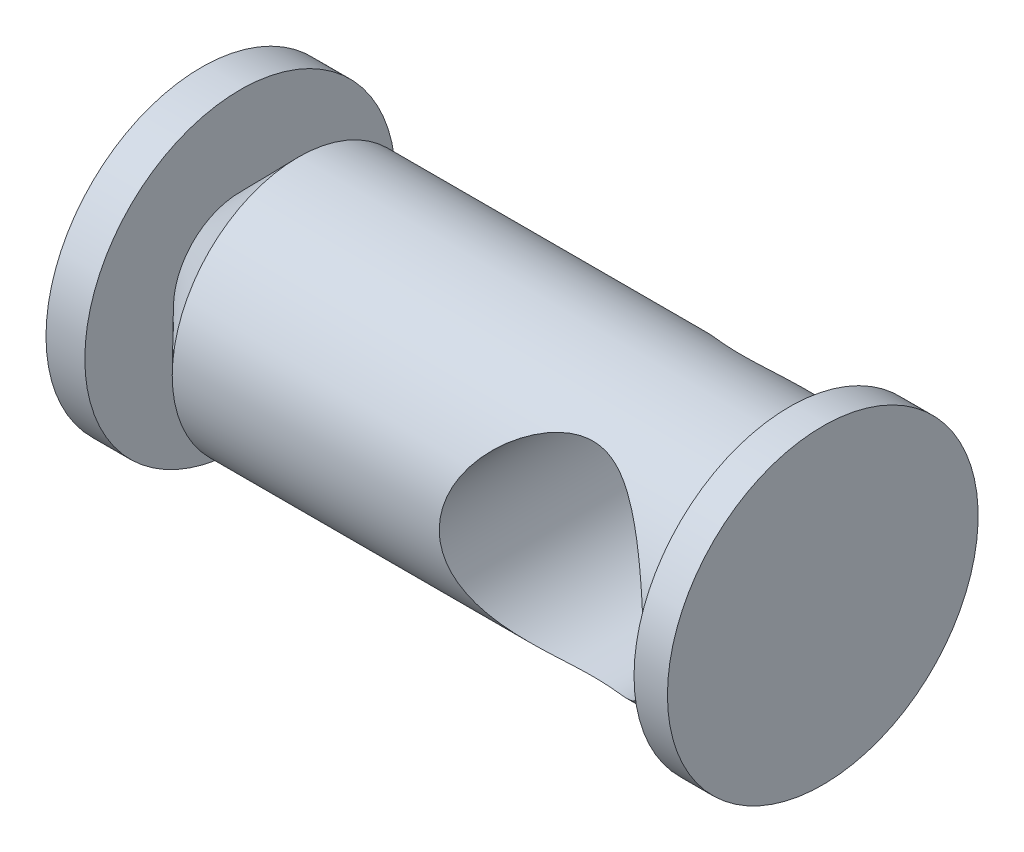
ISO-10303-21;
HEADER;
FILE_DESCRIPTION(('STEP AP214'),'2;1');
FILE_NAME('part.step','',(''),(''),'','','');
FILE_SCHEMA(('AUTOMOTIVE_DESIGN { 1 0 10303 214 1 1 1 1 }'));
ENDSEC;
DATA;
#1=APPLICATION_CONTEXT('core data for automotive mechanical design processes');
#2=APPLICATION_PROTOCOL_DEFINITION('international standard','automotive_design',2000,#1);
#3=PRODUCT_CONTEXT('',#1,'mechanical');
#4=PRODUCT('Part','Part','',(#3));
#5=PRODUCT_RELATED_PRODUCT_CATEGORY('part','',(#4));
#6=PRODUCT_DEFINITION_FORMATION('','',#4);
#7=PRODUCT_DEFINITION_CONTEXT('part definition',#1,'design');
#8=PRODUCT_DEFINITION('design','',#6,#7);
#9=PRODUCT_DEFINITION_SHAPE('','',#8);
#10=(LENGTH_UNIT() NAMED_UNIT(*) SI_UNIT(.MILLI.,.METRE.));
#11=(NAMED_UNIT(*) PLANE_ANGLE_UNIT() SI_UNIT($,.RADIAN.));
#12=(NAMED_UNIT(*) SI_UNIT($,.STERADIAN.) SOLID_ANGLE_UNIT());
#13=UNCERTAINTY_MEASURE_WITH_UNIT(LENGTH_MEASURE(1.E-05),#10,'distance_accuracy_value','');
#14=(GEOMETRIC_REPRESENTATION_CONTEXT(3) GLOBAL_UNCERTAINTY_ASSIGNED_CONTEXT((#13)) GLOBAL_UNIT_ASSIGNED_CONTEXT((#10,
#11,#12)) REPRESENTATION_CONTEXT('',''));
#15=CARTESIAN_POINT('',(0.,0.,0.));
#16=DIRECTION('',(0.,0.,1.));
#17=DIRECTION('',(1.,0.,0.));
#18=AXIS2_PLACEMENT_3D('',#15,#16,#17);
#19=CARTESIAN_POINT('',(-60.,8.,0.));
#20=DIRECTION('',(1.,0.,0.));
#21=DIRECTION('',(0.,0.,-1.));
#22=AXIS2_PLACEMENT_3D('',#19,#20,#21);
#23=PLANE('',#22);
#24=CARTESIAN_POINT('',(-60.,0.,0.));
#25=DIRECTION('',(-1.,0.,0.));
#26=DIRECTION('',(0.,0.,1.));
#27=AXIS2_PLACEMENT_3D('',#24,#25,#26);
#28=CIRCLE('',#27,3.);
#29=CARTESIAN_POINT('',(-60.,0.,3.));
#30=VERTEX_POINT('',#29);
#31=EDGE_CURVE('E104',#30,#30,#28,.T.);
#32=ORIENTED_EDGE('',*,*,#31,.F.);
#33=EDGE_LOOP('',(#32));
#34=FACE_BOUND('',#33,.T.);
#35=CARTESIAN_POINT('',(-60.,0.,0.));
#36=DIRECTION('',(-1.,0.,0.));
#37=DIRECTION('',(0.,0.,1.));
#38=AXIS2_PLACEMENT_3D('',#35,#36,#37);
#39=CIRCLE('',#38,8.);
#40=CARTESIAN_POINT('',(-60.,0.,8.));
#41=VERTEX_POINT('',#40);
#42=EDGE_CURVE('E142',#41,#41,#39,.T.);
#43=ORIENTED_EDGE('',*,*,#42,.T.);
#44=EDGE_LOOP('',(#43));
#45=FACE_BOUND('',#44,.T.);
#46=ADVANCED_FACE('F34',(#34,#45),#23,.F.);
#47=CARTESIAN_POINT('',(-90.,0.,0.));
#48=DIRECTION('',(-1.,0.,0.));
#49=DIRECTION('',(0.,0.,1.));
#50=AXIS2_PLACEMENT_3D('',#47,#48,#49);
#51=CYLINDRICAL_SURFACE('',#50,3.);
#52=CARTESIAN_POINT('',(-42.24,0.,0.));
#53=DIRECTION('',(-1.,0.,0.));
#54=DIRECTION('',(0.,0.,1.));
#55=AXIS2_PLACEMENT_3D('',#52,#53,#54);
#56=CIRCLE('',#55,3.);
#57=CARTESIAN_POINT('',(-42.24,0.,3.));
#58=VERTEX_POINT('',#57);
#59=EDGE_CURVE('E101',#58,#58,#56,.T.);
#60=ORIENTED_EDGE('',*,*,#59,.F.);
#61=EDGE_LOOP('',(#60));
#62=FACE_BOUND('',#61,.T.);
#63=ORIENTED_EDGE('',*,*,#31,.T.);
#64=EDGE_LOOP('',(#63));
#65=FACE_BOUND('',#64,.T.);
#66=ADVANCED_FACE('F131',(#62,#65),#51,.F.);
#67=CARTESIAN_POINT('',(-42.24,3.,0.));
#68=DIRECTION('',(1.,0.,0.));
#69=DIRECTION('',(0.,0.,-1.));
#70=AXIS2_PLACEMENT_3D('',#67,#68,#69);
#71=PLANE('',#70);
#72=ORIENTED_EDGE('',*,*,#59,.T.);
#73=EDGE_LOOP('',(#72));
#74=FACE_BOUND('',#73,.T.);
#75=ADVANCED_FACE('F136',(#74),#71,.F.);
#76=CARTESIAN_POINT('',(-28.,8.,0.));
#77=DIRECTION('',(-1.,0.,0.));
#78=DIRECTION('',(0.,0.,1.));
#79=AXIS2_PLACEMENT_3D('',#76,#77,#78);
#80=PLANE('',#79);
#81=CARTESIAN_POINT('',(-28.,0.,0.));
#82=DIRECTION('',(-1.,0.,0.));
#83=DIRECTION('',(0.,0.,1.));
#84=AXIS2_PLACEMENT_3D('',#81,#82,#83);
#85=CIRCLE('',#84,8.);
#86=CARTESIAN_POINT('',(-28.,0.,8.));
#87=VERTEX_POINT('',#86);
#88=EDGE_CURVE('E93',#87,#87,#85,.T.);
#89=ORIENTED_EDGE('',*,*,#88,.F.);
#90=EDGE_LOOP('',(#89));
#91=FACE_BOUND('',#90,.T.);
#92=ADVANCED_FACE('F157',(#91),#80,.F.);
#93=CARTESIAN_POINT('',(-90.,0.,0.));
#94=DIRECTION('',(-1.,0.,0.));
#95=DIRECTION('',(0.,0.,1.));
#96=AXIS2_PLACEMENT_3D('',#93,#94,#95);
#97=CYLINDRICAL_SURFACE('',#96,8.);
#98=CARTESIAN_POINT('',(-29.72,0.,0.));
#99=DIRECTION('',(-1.,0.,0.));
#100=DIRECTION('',(0.,0.,1.));
#101=AXIS2_PLACEMENT_3D('',#98,#99,#100);
#102=CIRCLE('',#101,8.);
#103=CARTESIAN_POINT('',(-29.72,0.,8.));
#104=VERTEX_POINT('',#103);
#105=EDGE_CURVE('E90',#104,#104,#102,.T.);
#106=ORIENTED_EDGE('',*,*,#105,.F.);
#107=EDGE_LOOP('',(#106));
#108=FACE_BOUND('',#107,.T.);
#109=ORIENTED_EDGE('',*,*,#88,.T.);
#110=EDGE_LOOP('',(#109));
#111=FACE_BOUND('',#110,.T.);
#112=ADVANCED_FACE('F164',(#108,#111),#97,.T.);
#113=CARTESIAN_POINT('',(-29.72,8.,0.));
#114=DIRECTION('',(1.,0.,0.));
#115=DIRECTION('',(0.,0.,-1.));
#116=AXIS2_PLACEMENT_3D('',#113,#114,#115);
#117=PLANE('',#116);
#118=CARTESIAN_POINT('',(-29.72,0.,0.));
#119=DIRECTION('',(-1.,0.,0.));
#120=DIRECTION('',(0.,0.,1.));
#121=AXIS2_PLACEMENT_3D('',#118,#119,#120);
#122=CIRCLE('',#121,6.5);
#123=CARTESIAN_POINT('',(-29.72,0.,6.5));
#124=VERTEX_POINT('',#123);
#125=EDGE_CURVE('E88',#124,#124,#122,.T.);
#126=ORIENTED_EDGE('',*,*,#125,.F.);
#127=EDGE_LOOP('',(#126));
#128=FACE_BOUND('',#127,.T.);
#129=ORIENTED_EDGE('',*,*,#105,.T.);
#130=EDGE_LOOP('',(#129));
#131=FACE_BOUND('',#130,.T.);
#132=ADVANCED_FACE('F78',(#128,#131),#117,.F.);
#133=CARTESIAN_POINT('',(-90.,0.,0.));
#134=DIRECTION('',(-1.,0.,0.));
#135=DIRECTION('',(0.,0.,1.));
#136=AXIS2_PLACEMENT_3D('',#133,#134,#135);
#137=CYLINDRICAL_SURFACE('',#136,6.5);
#138=CARTESIAN_POINT('',(-30.75,0.,6.5));
#139=CARTESIAN_POINT('',(-30.7499995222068,-0.125782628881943,6.500000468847));
#140=CARTESIAN_POINT('',(-30.7545270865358,-0.251559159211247,6.49634188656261));
#141=CARTESIAN_POINT('',(-30.772555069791,-0.502093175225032,6.48179388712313));
#142=CARTESIAN_POINT('',(-30.7860588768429,-0.626850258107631,6.47090173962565));
#143=CARTESIAN_POINT('',(-30.8218200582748,-0.874422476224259,6.44212192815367));
#144=CARTESIAN_POINT('',(-30.8440872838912,-0.997235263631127,6.42422639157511));
#145=CARTESIAN_POINT('',(-30.8970085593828,-1.23992488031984,6.38183133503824));
#146=CARTESIAN_POINT('',(-30.9276664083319,-1.35980035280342,6.35732882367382));
#147=CARTESIAN_POINT('',(-30.9966637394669,-1.5950055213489,6.30241536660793));
#148=CARTESIAN_POINT('',(-31.0349501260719,-1.71036038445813,6.27204530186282));
#149=CARTESIAN_POINT('',(-31.1188193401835,-1.93679525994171,6.20586540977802));
#150=CARTESIAN_POINT('',(-31.1644053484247,-2.04787338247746,6.1700532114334));
#151=CARTESIAN_POINT('',(-31.3113039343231,-2.37388942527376,6.05537693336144));
#152=CARTESIAN_POINT('',(-31.4228190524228,-2.58181599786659,5.96922320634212));
#153=CARTESIAN_POINT('',(-31.6290417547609,-2.9123953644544,5.8129033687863));
#154=CARTESIAN_POINT('',(-31.7175463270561,-3.04090096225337,5.74655985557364));
#155=CARTESIAN_POINT('',(-31.9041427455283,-3.28791456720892,5.60888350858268));
#156=CARTESIAN_POINT('',(-32.0022342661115,-3.40642291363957,5.53755084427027));
#157=CARTESIAN_POINT('',(-32.2074783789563,-3.63356453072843,5.39124492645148));
#158=CARTESIAN_POINT('',(-32.3146555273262,-3.74216927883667,5.31626205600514));
#159=CARTESIAN_POINT('',(-32.5372757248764,-3.94906684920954,5.16442908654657));
#160=CARTESIAN_POINT('',(-32.652717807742,-4.04736087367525,5.0875792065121));
#161=CARTESIAN_POINT('',(-32.8935240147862,-4.23509115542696,4.93245034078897));
#162=CARTESIAN_POINT('',(-33.0190191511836,-4.32435700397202,4.85416847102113));
#163=CARTESIAN_POINT('',(-33.2782228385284,-4.49202270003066,4.69944073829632));
#164=CARTESIAN_POINT('',(-33.4119340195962,-4.57041904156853,4.62299547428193));
#165=CARTESIAN_POINT('',(-33.6873357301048,-4.71574503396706,4.47465020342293));
#166=CARTESIAN_POINT('',(-33.8290038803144,-4.78270489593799,4.4027385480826));
#167=CARTESIAN_POINT('',(-34.1207188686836,-4.90467112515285,4.26644514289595));
#168=CARTESIAN_POINT('',(-34.2707583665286,-4.95968776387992,4.20205694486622));
#169=CARTESIAN_POINT('',(-34.6006179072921,-5.06339450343,4.07670706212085));
#170=CARTESIAN_POINT('',(-34.7817094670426,-5.11019986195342,4.01740894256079));
#171=CARTESIAN_POINT('',(-35.0602623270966,-5.16607786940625,3.9449425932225));
#172=CARTESIAN_POINT('',(-35.1541996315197,-5.18230935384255,3.92354291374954));
#173=CARTESIAN_POINT('',(-35.3439983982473,-5.2097352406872,3.88705304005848));
#174=CARTESIAN_POINT('',(-35.439858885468,-5.22093213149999,3.87195972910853));
#175=CARTESIAN_POINT('',(-35.6338612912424,-5.23813123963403,3.84866158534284));
#176=CARTESIAN_POINT('',(-35.7320164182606,-5.24408068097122,3.84052676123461));
#177=CARTESIAN_POINT('',(-35.9288411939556,-5.25044086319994,3.83182734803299));
#178=CARTESIAN_POINT('',(-36.0275108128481,-5.25085192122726,3.83126232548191));
#179=CARTESIAN_POINT('',(-36.2245039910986,-5.24612328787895,3.83773444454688));
#180=CARTESIAN_POINT('',(-36.3228273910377,-5.24098130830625,3.84477472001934));
#181=CARTESIAN_POINT('',(-36.5182839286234,-5.22527550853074,3.86609217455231));
#182=CARTESIAN_POINT('',(-36.615416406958,-5.21470881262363,3.88037319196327));
#183=CARTESIAN_POINT('',(-36.8213890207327,-5.18653046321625,3.91797473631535));
#184=CARTESIAN_POINT('',(-36.9299397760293,-5.16813320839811,3.94228879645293));
#185=CARTESIAN_POINT('',(-37.1439050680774,-5.12502799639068,3.99816663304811));
#186=CARTESIAN_POINT('',(-37.2493172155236,-5.1003153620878,4.02973578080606));
#187=CARTESIAN_POINT('',(-37.5606762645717,-5.01726981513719,4.13337481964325));
#188=CARTESIAN_POINT('',(-37.7613749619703,-4.95008250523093,4.21430008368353));
#189=CARTESIAN_POINT('',(-38.1009102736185,-4.81389553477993,4.36856113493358));
#190=CARTESIAN_POINT('',(-38.2429550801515,-4.74927769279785,4.43898647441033));
#191=CARTESIAN_POINT('',(-38.5189393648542,-4.60883970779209,4.58462913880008));
#192=CARTESIAN_POINT('',(-38.6528748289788,-4.53301407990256,4.65984879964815));
#193=CARTESIAN_POINT('',(-38.9128414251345,-4.37051345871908,4.81259531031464));
#194=CARTESIAN_POINT('',(-39.0388627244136,-4.28382535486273,4.89012486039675));
#195=CARTESIAN_POINT('',(-39.2828007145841,-4.09988333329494,5.04533832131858));
#196=CARTESIAN_POINT('',(-39.4007187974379,-4.00263123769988,5.12302220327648));
#197=CARTESIAN_POINT('',(-39.6317967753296,-3.79440332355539,5.27920200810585));
#198=CARTESIAN_POINT('',(-39.7446894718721,-3.68309151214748,5.3576463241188));
#199=CARTESIAN_POINT('',(-39.9610347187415,-3.44935650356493,5.51103277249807));
#200=CARTESIAN_POINT('',(-40.0644858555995,-3.32693164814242,5.58597437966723));
#201=CARTESIAN_POINT('',(-40.2608429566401,-3.07141972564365,5.73043405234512));
#202=CARTESIAN_POINT('',(-40.3537718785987,-2.93835699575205,5.79996381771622));
#203=CARTESIAN_POINT('',(-40.5281983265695,-2.66169704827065,5.93201788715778));
#204=CARTESIAN_POINT('',(-40.6097008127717,-2.51810444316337,5.99454522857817));
#205=CARTESIAN_POINT('',(-40.7387624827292,-2.26294471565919,6.09444076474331));
#206=CARTESIAN_POINT('',(-40.7894133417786,-2.15376111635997,6.13393231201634));
#207=CARTESIAN_POINT('',(-40.8836023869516,-1.93069315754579,6.20775449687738));
#208=CARTESIAN_POINT('',(-40.9271423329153,-1.81680996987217,6.24208641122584));
#209=CARTESIAN_POINT('',(-41.0065655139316,-1.58487320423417,6.30496709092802));
#210=CARTESIAN_POINT('',(-41.0424504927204,-1.46682058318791,6.33351717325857));
#211=CARTESIAN_POINT('',(-41.1060461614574,-1.22724988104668,6.38426503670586));
#212=CARTESIAN_POINT('',(-41.1337607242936,-1.10573347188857,6.40646582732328));
#213=CARTESIAN_POINT('',(-41.1807325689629,-0.859267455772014,6.4441673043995));
#214=CARTESIAN_POINT('',(-41.1999378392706,-0.734301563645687,6.45962677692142));
#215=CARTESIAN_POINT('',(-41.2293041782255,-0.482625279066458,6.483289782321));
#216=CARTESIAN_POINT('',(-41.239465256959,-0.35591488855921,6.4914933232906));
#217=CARTESIAN_POINT('',(-41.2505513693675,-0.101852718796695,6.5004445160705));
#218=CARTESIAN_POINT('',(-41.2514783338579,0.0254989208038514,6.50119372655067));
#219=CARTESIAN_POINT('',(-41.2440837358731,0.279749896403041,6.49522205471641));
#220=CARTESIAN_POINT('',(-41.2357627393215,0.406649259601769,6.48850162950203));
#221=CARTESIAN_POINT('',(-41.2111799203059,0.64763609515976,6.46868210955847));
#222=CARTESIAN_POINT('',(-41.1956941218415,0.761855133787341,6.45620666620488));
#223=CARTESIAN_POINT('',(-41.157422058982,0.98828353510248,6.42544752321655));
#224=CARTESIAN_POINT('',(-41.1346333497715,1.10049221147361,6.40716187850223));
#225=CARTESIAN_POINT('',(-41.0557656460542,1.43300565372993,6.34407169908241));
#226=CARTESIAN_POINT('',(-40.9891668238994,1.64937084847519,6.2910189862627));
#227=CARTESIAN_POINT('',(-40.8270200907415,2.07791030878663,6.163197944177));
#228=CARTESIAN_POINT('',(-40.7301364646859,2.28926886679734,6.08743617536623));
#229=CARTESIAN_POINT('',(-40.512780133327,2.69254734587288,5.92012424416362));
#230=CARTESIAN_POINT('',(-40.3923051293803,2.88446536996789,5.82857254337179));
#231=CARTESIAN_POINT('',(-40.1067755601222,3.281357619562,5.616255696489));
#232=CARTESIAN_POINT('',(-39.9375971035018,3.48213346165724,5.49322311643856));
#233=CARTESIAN_POINT('',(-39.5741058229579,3.85437251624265,5.23877017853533));
#234=CARTESIAN_POINT('',(-39.3797306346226,4.02576046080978,5.1073294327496));
#235=CARTESIAN_POINT('',(-39.0481295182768,4.2774173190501,4.89584413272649));
#236=CARTESIAN_POINT('',(-38.9180725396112,4.36720278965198,4.81568915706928));
#237=CARTESIAN_POINT('',(-38.6492539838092,4.53531794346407,4.65770118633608));
#238=CARTESIAN_POINT('',(-38.5104881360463,4.6136419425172,4.57986935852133));
#239=CARTESIAN_POINT('',(-38.2245021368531,4.75811708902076,4.42957750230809));
#240=CARTESIAN_POINT('',(-38.0773053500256,4.82429992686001,4.35710379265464));
#241=CARTESIAN_POINT('',(-37.774068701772,4.94385844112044,4.22095438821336));
#242=CARTESIAN_POINT('',(-37.618038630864,4.99724796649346,4.15726921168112));
#243=CARTESIAN_POINT('',(-37.2828113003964,5.09409817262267,4.03814295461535));
#244=CARTESIAN_POINT('',(-37.1027822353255,5.13627799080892,3.98391416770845));
#245=CARTESIAN_POINT('',(-36.8265361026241,5.18537256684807,3.91951975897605));
#246=CARTESIAN_POINT('',(-36.7334949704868,5.19936951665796,3.90088766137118));
#247=CARTESIAN_POINT('',(-36.5457727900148,5.2224093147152,3.86998912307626));
#248=CARTESIAN_POINT('',(-36.4510925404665,5.23145450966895,3.85771966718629));
#249=CARTESIAN_POINT('',(-36.2599427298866,5.24444304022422,3.84004433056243));
#250=CARTESIAN_POINT('',(-36.1634648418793,5.24834345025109,3.83469620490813));
#251=CARTESIAN_POINT('',(-35.9703142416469,5.25080428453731,3.83132602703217));
#252=CARTESIAN_POINT('',(-35.8736415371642,5.24936491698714,3.83330368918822));
#253=CARTESIAN_POINT('',(-35.6808677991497,5.24118025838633,3.84448648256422));
#254=CARTESIAN_POINT('',(-35.5847672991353,5.23443061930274,3.8536975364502));
#255=CARTESIAN_POINT('',(-35.3939308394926,5.21578193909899,3.87889953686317));
#256=CARTESIAN_POINT('',(-35.2991956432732,5.20388012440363,3.89489413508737));
#257=CARTESIAN_POINT('',(-35.0931631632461,5.17233504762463,3.93672004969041));
#258=CARTESIAN_POINT('',(-34.9822978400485,5.15162597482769,3.96387152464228));
#259=CARTESIAN_POINT('',(-34.7640076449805,5.10365856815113,4.02544252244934));
#260=CARTESIAN_POINT('',(-34.6565855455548,5.07639509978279,4.05986774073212));
#261=CARTESIAN_POINT('',(-34.4453010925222,5.0157275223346,4.13458532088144));
#262=CARTESIAN_POINT('',(-34.3414479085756,4.98230882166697,4.17489157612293));
#263=CARTESIAN_POINT('',(-34.1376877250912,4.90978469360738,4.2599460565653));
#264=CARTESIAN_POINT('',(-34.0377797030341,4.87068075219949,4.30469312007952));
#265=CARTESIAN_POINT('',(-33.7924193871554,4.76600192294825,4.42086266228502));
#266=CARTESIAN_POINT('',(-33.649395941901,4.69701986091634,4.49436143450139));
#267=CARTESIAN_POINT('',(-33.3718232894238,4.54753216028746,4.64556515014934));
#268=CARTESIAN_POINT('',(-33.237278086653,4.46702113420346,4.72327204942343));
#269=CARTESIAN_POINT('',(-32.9764145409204,4.29475077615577,4.88044353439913));
#270=CARTESIAN_POINT('',(-32.8501057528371,4.20297872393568,4.95991002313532));
#271=CARTESIAN_POINT('',(-32.6060048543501,4.00844695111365,5.11840771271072));
#272=CARTESIAN_POINT('',(-32.4882112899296,3.90568911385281,5.19743898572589));
#273=CARTESIAN_POINT('',(-32.2587125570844,3.68660308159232,5.35514884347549));
#274=CARTESIAN_POINT('',(-32.1472261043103,3.57000492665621,5.43377176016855));
#275=CARTESIAN_POINT('',(-31.9342312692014,3.32540533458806,5.58681431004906));
#276=CARTESIAN_POINT('',(-31.8327245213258,3.19740203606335,5.66123325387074));
#277=CARTESIAN_POINT('',(-31.6409272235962,2.93051650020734,5.80387095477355));
#278=CARTESIAN_POINT('',(-31.5506122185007,2.7916591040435,5.87210313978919));
#279=CARTESIAN_POINT('',(-31.3822310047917,2.5033071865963,6.00069484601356));
#280=CARTESIAN_POINT('',(-31.3041583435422,2.35381832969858,6.06105851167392));
#281=CARTESIAN_POINT('',(-31.1833647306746,2.09201642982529,6.15520232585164));
#282=CARTESIAN_POINT('',(-31.1371121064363,1.98221747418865,6.19148522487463));
#283=CARTESIAN_POINT('',(-31.0517504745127,1.75831491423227,6.25875242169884));
#284=CARTESIAN_POINT('',(-31.0126396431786,1.64421241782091,6.28973807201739));
#285=CARTESIAN_POINT('',(-30.9421260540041,1.41246353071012,6.34579643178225));
#286=CARTESIAN_POINT('',(-30.9107094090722,1.29482396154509,6.37087979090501));
#287=CARTESIAN_POINT('',(-30.8559619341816,1.0565553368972,6.41469862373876));
#288=CARTESIAN_POINT('',(-30.8326283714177,0.935927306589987,6.43343624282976));
#289=CARTESIAN_POINT('',(-30.7925015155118,0.680309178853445,6.46570823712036));
#290=CARTESIAN_POINT('',(-30.7765946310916,0.545088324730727,6.47853567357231));
#291=CARTESIAN_POINT('',(-30.7553427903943,0.273242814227,6.49568238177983));
#292=CARTESIAN_POINT('',(-30.7500005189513,0.136617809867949,6.49999949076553));
#293=CARTESIAN_POINT('',(-30.75,0.,6.5));
#294=B_SPLINE_CURVE_WITH_KNOTS('',3,(#138,#139,#140,#141,#142,#143,#144,#145,#146,#147,#148,
#149,#150,#151,#152,#153,#154,#155,#156,#157,#158,#159,#160,#161,#162,#163,#164,#165,#166,#167,
#168,#169,#170,#171,#172,#173,#174,#175,#176,#177,#178,#179,#180,#181,#182,#183,#184,#185,#186,
#187,#188,#189,#190,#191,#192,#193,#194,#195,#196,#197,#198,#199,#200,#201,#202,#203,#204,#205,
#206,#207,#208,#209,#210,#211,#212,#213,#214,#215,#216,#217,#218,#219,#220,#221,#222,#223,#224,
#225,#226,#227,#228,#229,#230,#231,#232,#233,#234,#235,#236,#237,#238,#239,#240,#241,#242,#243,
#244,#245,#246,#247,#248,#249,#250,#251,#252,#253,#254,#255,#256,#257,#258,#259,#260,#261,#262,
#263,#264,#265,#266,#267,#268,#269,#270,#271,#272,#273,#274,#275,#276,#277,#278,#279,#280,#281,
#282,#283,#284,#285,#286,#287,#288,#289,#290,#291,#292,#293),.UNSPECIFIED.,.T.,.F.,(4,2,2,2,2,2,
2,2,2,2,2,2,2,2,2,2,2,2,2,2,2,2,2,2,2,2,2,2,2,2,2,2,2,2,2,2,2,2,2,2,2,2,2,2,2,2,2,2,2,2,2,2,2,2,
2,2,2,2,2,2,2,2,2,2,2,2,2,2,2,2,2,2,2,2,2,2,2,4),(0.,0.377204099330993,0.754550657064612,
1.13232261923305,1.51026591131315,1.88566519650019,2.26122850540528,3.01169693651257,
3.51979688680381,4.02787958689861,4.53738218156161,5.04682530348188,5.56456860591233,
6.0824785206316,6.59899839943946,7.11507228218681,7.70149558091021,7.99430919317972,
8.28697791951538,8.58255764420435,8.87812044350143,9.17380507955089,9.46964662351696,
9.80737228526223,10.1453487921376,10.8224345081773,11.3354984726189,11.848814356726,
12.3627558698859,12.8766088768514,13.4066613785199,13.9367931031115,14.4657449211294,
14.9944664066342,15.374135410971,15.7537103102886,16.1331986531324,16.5125068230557,
16.8941024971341,17.2756977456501,17.6572132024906,18.0387053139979,18.3861078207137,
18.7336267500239,19.4281469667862,20.1591121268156,20.890148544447,21.7569977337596,
22.6260349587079,23.1571371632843,23.6885018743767,24.2184592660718,24.7478403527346,
25.3236335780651,25.6110840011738,25.8983980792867,26.188094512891,26.4777796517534,
26.767702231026,27.0577810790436,27.4052575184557,27.7530070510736,28.1015918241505,
28.4500856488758,28.9742514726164,29.4986630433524,30.0236725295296,30.5485921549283,
31.0863211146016,31.6241379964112,32.160758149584,32.6970945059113,33.0703808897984,
33.4435718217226,33.8160841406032,34.1884703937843,34.598063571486,35.0077608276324),.UNSPECIFIED.);
#295=CARTESIAN_POINT('',(-30.75,0.,6.5));
#296=VERTEX_POINT('',#295);
#297=EDGE_CURVE('E37',#296,#296,#294,.T.);
#298=ORIENTED_EDGE('',*,*,#297,.T.);
#299=EDGE_LOOP('',(#298));
#300=FACE_BOUND('',#299,.T.);
#301=DIRECTION('',(-1.,0.,0.));
#302=VECTOR('',#301,1.);
#303=CARTESIAN_POINT('',(-90.,3.69154439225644,-5.35));
#304=LINE('',#303,#302);
#305=CARTESIAN_POINT('',(-32.267038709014,3.69154439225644,-5.35));
#306=VERTEX_POINT('',#305);
#307=CARTESIAN_POINT('',(-39.732961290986,3.69154439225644,-5.35));
#308=VERTEX_POINT('',#307);
#309=EDGE_CURVE('E46',#306,#308,#304,.T.);
#310=ORIENTED_EDGE('',*,*,#309,.F.);
#311=CARTESIAN_POINT('',(-30.75,0.,-6.5));
#312=CARTESIAN_POINT('',(-30.7499995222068,0.125782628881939,-6.500000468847));
#313=CARTESIAN_POINT('',(-30.7545270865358,0.251559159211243,-6.49634188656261));
#314=CARTESIAN_POINT('',(-30.772555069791,0.502093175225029,-6.48179388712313));
#315=CARTESIAN_POINT('',(-30.7860588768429,0.626850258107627,-6.47090173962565));
#316=CARTESIAN_POINT('',(-30.8218200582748,0.874422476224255,-6.44212192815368));
#317=CARTESIAN_POINT('',(-30.8440872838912,0.997235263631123,-6.42422639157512));
#318=CARTESIAN_POINT('',(-30.8970085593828,1.23992488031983,-6.38183133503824));
#319=CARTESIAN_POINT('',(-30.9276664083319,1.35980035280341,-6.35732882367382));
#320=CARTESIAN_POINT('',(-30.9966637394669,1.5950055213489,-6.30241536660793));
#321=CARTESIAN_POINT('',(-31.0349501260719,1.71036038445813,-6.27204530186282));
#322=CARTESIAN_POINT('',(-31.1188193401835,1.93679525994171,-6.20586540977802));
#323=CARTESIAN_POINT('',(-31.1644053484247,2.04787338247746,-6.1700532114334));
#324=CARTESIAN_POINT('',(-31.3113039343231,2.37388942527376,-6.05537693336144));
#325=CARTESIAN_POINT('',(-31.4228190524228,2.58181599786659,-5.96922320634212));
#326=CARTESIAN_POINT('',(-31.6290417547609,2.9123953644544,-5.8129033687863));
#327=CARTESIAN_POINT('',(-31.7175463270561,3.04090096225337,-5.74655985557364));
#328=CARTESIAN_POINT('',(-31.9041427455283,3.28791456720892,-5.60888350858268));
#329=CARTESIAN_POINT('',(-32.0022342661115,3.40642291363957,-5.53755084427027));
#330=CARTESIAN_POINT('',(-32.2074783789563,3.63356453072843,-5.39124492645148));
#331=CARTESIAN_POINT('',(-32.3146555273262,3.74216927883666,-5.31626205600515));
#332=CARTESIAN_POINT('',(-32.5372757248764,3.94906684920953,-5.16442908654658));
#333=CARTESIAN_POINT('',(-32.652717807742,4.04736087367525,-5.0875792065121));
#334=CARTESIAN_POINT('',(-32.8935240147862,4.23509115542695,-4.93245034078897));
#335=CARTESIAN_POINT('',(-33.0190191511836,4.32435700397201,-4.85416847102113));
#336=CARTESIAN_POINT('',(-33.2782228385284,4.49202270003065,-4.69944073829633));
#337=CARTESIAN_POINT('',(-33.4119340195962,4.57041904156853,-4.62299547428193));
#338=CARTESIAN_POINT('',(-33.6873357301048,4.71574503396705,-4.47465020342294));
#339=CARTESIAN_POINT('',(-33.8290038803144,4.78270489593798,-4.40273854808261));
#340=CARTESIAN_POINT('',(-34.1207188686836,4.90467112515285,-4.26644514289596));
#341=CARTESIAN_POINT('',(-34.2707583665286,4.95968776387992,-4.20205694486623));
#342=CARTESIAN_POINT('',(-34.6006179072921,5.06339450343,-4.07670706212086));
#343=CARTESIAN_POINT('',(-34.7817094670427,5.11019986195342,-4.0174089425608));
#344=CARTESIAN_POINT('',(-35.0602623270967,5.16607786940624,-3.94494259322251));
#345=CARTESIAN_POINT('',(-35.1541996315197,5.18230935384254,-3.92354291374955));
#346=CARTESIAN_POINT('',(-35.3439983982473,5.2097352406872,-3.88705304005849));
#347=CARTESIAN_POINT('',(-35.439858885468,5.22093213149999,-3.87195972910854));
#348=CARTESIAN_POINT('',(-35.6338612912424,5.23813123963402,-3.84866158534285));
#349=CARTESIAN_POINT('',(-35.7320164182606,5.24408068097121,-3.84052676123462));
#350=CARTESIAN_POINT('',(-35.9288411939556,5.25044086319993,-3.83182734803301));
#351=CARTESIAN_POINT('',(-36.0275108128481,5.25085192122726,-3.83126232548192));
#352=CARTESIAN_POINT('',(-36.2245039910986,5.24612328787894,-3.8377344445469));
#353=CARTESIAN_POINT('',(-36.3228273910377,5.24098130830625,-3.84477472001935));
#354=CARTESIAN_POINT('',(-36.5182839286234,5.22527550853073,-3.86609217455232));
#355=CARTESIAN_POINT('',(-36.615416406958,5.21470881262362,-3.88037319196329));
#356=CARTESIAN_POINT('',(-36.8213890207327,5.18653046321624,-3.91797473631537));
#357=CARTESIAN_POINT('',(-36.9299397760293,5.1681332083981,-3.94228879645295));
#358=CARTESIAN_POINT('',(-37.1439050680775,5.12502799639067,-3.99816663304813));
#359=CARTESIAN_POINT('',(-37.2493172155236,5.10031536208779,-4.02973578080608));
#360=CARTESIAN_POINT('',(-37.5606762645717,5.01726981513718,-4.13337481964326));
#361=CARTESIAN_POINT('',(-37.7613749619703,4.95008250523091,-4.21430008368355));
#362=CARTESIAN_POINT('',(-38.1009102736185,4.81389553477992,-4.3685611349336));
#363=CARTESIAN_POINT('',(-38.2429550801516,4.74927769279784,-4.43898647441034));
#364=CARTESIAN_POINT('',(-38.5189393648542,4.60883970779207,-4.5846291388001));
#365=CARTESIAN_POINT('',(-38.6528748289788,4.53301407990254,-4.65984879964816));
#366=CARTESIAN_POINT('',(-38.9128414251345,4.37051345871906,-4.81259531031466));
#367=CARTESIAN_POINT('',(-39.0388627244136,4.28382535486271,-4.89012486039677));
#368=CARTESIAN_POINT('',(-39.2828007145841,4.09988333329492,-5.0453383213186));
#369=CARTESIAN_POINT('',(-39.4007187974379,4.00263123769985,-5.12302220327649));
#370=CARTESIAN_POINT('',(-39.6317967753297,3.79440332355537,-5.27920200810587));
#371=CARTESIAN_POINT('',(-39.7446894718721,3.68309151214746,-5.35764632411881));
#372=CARTESIAN_POINT('',(-39.9610347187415,3.44935650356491,-5.51103277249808));
#373=CARTESIAN_POINT('',(-40.0644858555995,3.3269316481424,-5.58597437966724));
#374=CARTESIAN_POINT('',(-40.2608429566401,3.07141972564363,-5.73043405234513));
#375=CARTESIAN_POINT('',(-40.3537718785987,2.93835699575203,-5.79996381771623));
#376=CARTESIAN_POINT('',(-40.5281983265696,2.66169704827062,-5.93201788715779));
#377=CARTESIAN_POINT('',(-40.6097008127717,2.51810444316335,-5.99454522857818));
#378=CARTESIAN_POINT('',(-40.7387624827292,2.26294471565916,-6.09444076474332));
#379=CARTESIAN_POINT('',(-40.7894133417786,2.15376111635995,-6.13393231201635));
#380=CARTESIAN_POINT('',(-40.8836023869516,1.93069315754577,-6.20775449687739));
#381=CARTESIAN_POINT('',(-40.9271423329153,1.81680996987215,-6.24208641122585));
#382=CARTESIAN_POINT('',(-41.0065655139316,1.58487320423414,-6.30496709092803));
#383=CARTESIAN_POINT('',(-41.0424504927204,1.46682058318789,-6.33351717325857));
#384=CARTESIAN_POINT('',(-41.1060461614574,1.22724988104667,-6.38426503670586));
#385=CARTESIAN_POINT('',(-41.1337607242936,1.10573347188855,-6.40646582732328));
#386=CARTESIAN_POINT('',(-41.1807325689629,0.859267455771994,-6.44416730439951));
#387=CARTESIAN_POINT('',(-41.1999378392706,0.734301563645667,-6.45962677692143));
#388=CARTESIAN_POINT('',(-41.2293041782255,0.482625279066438,-6.483289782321));
#389=CARTESIAN_POINT('',(-41.239465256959,0.355914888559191,-6.4914933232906));
#390=CARTESIAN_POINT('',(-41.2505513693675,0.101852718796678,-6.5004445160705));
#391=CARTESIAN_POINT('',(-41.2514783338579,-0.0254989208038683,-6.50119372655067));
#392=CARTESIAN_POINT('',(-41.2440837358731,-0.279749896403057,-6.49522205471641));
#393=CARTESIAN_POINT('',(-41.2357627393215,-0.406649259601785,-6.48850162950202));
#394=CARTESIAN_POINT('',(-41.2111799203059,-0.647636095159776,-6.46868210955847));
#395=CARTESIAN_POINT('',(-41.1956941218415,-0.761855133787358,-6.45620666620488));
#396=CARTESIAN_POINT('',(-41.157422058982,-0.988283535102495,-6.42544752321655));
#397=CARTESIAN_POINT('',(-41.1346333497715,-1.10049221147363,-6.40716187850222));
#398=CARTESIAN_POINT('',(-41.0557656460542,-1.43300565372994,-6.3440716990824));
#399=CARTESIAN_POINT('',(-40.9891668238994,-1.64937084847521,-6.2910189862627));
#400=CARTESIAN_POINT('',(-40.8270200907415,-2.07791030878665,-6.16319794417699));
#401=CARTESIAN_POINT('',(-40.7301364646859,-2.28926886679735,-6.08743617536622));
#402=CARTESIAN_POINT('',(-40.512780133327,-2.6925473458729,-5.92012424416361));
#403=CARTESIAN_POINT('',(-40.3923051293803,-2.8844653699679,-5.82857254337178));
#404=CARTESIAN_POINT('',(-40.1067755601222,-3.28135761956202,-5.61625569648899));
#405=CARTESIAN_POINT('',(-39.9375971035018,-3.48213346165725,-5.49322311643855));
#406=CARTESIAN_POINT('',(-39.5741058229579,-3.85437251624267,-5.23877017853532));
#407=CARTESIAN_POINT('',(-39.3797306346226,-4.02576046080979,-5.10732943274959));
#408=CARTESIAN_POINT('',(-39.0481295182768,-4.27741731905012,-4.89584413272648));
#409=CARTESIAN_POINT('',(-38.9180725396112,-4.367202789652,-4.81568915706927));
#410=CARTESIAN_POINT('',(-38.6492539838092,-4.53531794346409,-4.65770118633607));
#411=CARTESIAN_POINT('',(-38.5104881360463,-4.61364194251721,-4.57986935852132));
#412=CARTESIAN_POINT('',(-38.2245021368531,-4.75811708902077,-4.42957750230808));
#413=CARTESIAN_POINT('',(-38.0773053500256,-4.82429992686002,-4.35710379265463));
#414=CARTESIAN_POINT('',(-37.774068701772,-4.94385844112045,-4.22095438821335));
#415=CARTESIAN_POINT('',(-37.618038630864,-4.99724796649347,-4.15726921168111));
#416=CARTESIAN_POINT('',(-37.2828113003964,-5.09409817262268,-4.03814295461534));
#417=CARTESIAN_POINT('',(-37.1027822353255,-5.13627799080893,-3.98391416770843));
#418=CARTESIAN_POINT('',(-36.8265361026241,-5.18537256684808,-3.91951975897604));
#419=CARTESIAN_POINT('',(-36.7334949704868,-5.19936951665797,-3.90088766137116));
#420=CARTESIAN_POINT('',(-36.5457727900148,-5.22240931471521,-3.86998912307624));
#421=CARTESIAN_POINT('',(-36.4510925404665,-5.23145450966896,-3.85771966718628));
#422=CARTESIAN_POINT('',(-36.2599427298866,-5.24444304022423,-3.84004433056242));
#423=CARTESIAN_POINT('',(-36.1634648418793,-5.2483434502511,-3.83469620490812));
#424=CARTESIAN_POINT('',(-35.9703142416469,-5.25080428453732,-3.83132602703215));
#425=CARTESIAN_POINT('',(-35.8736415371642,-5.24936491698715,-3.83330368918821));
#426=CARTESIAN_POINT('',(-35.6808677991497,-5.24118025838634,-3.84448648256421));
#427=CARTESIAN_POINT('',(-35.5847672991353,-5.23443061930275,-3.85369753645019));
#428=CARTESIAN_POINT('',(-35.3939308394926,-5.215781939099,-3.87889953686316));
#429=CARTESIAN_POINT('',(-35.2991956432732,-5.20388012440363,-3.89489413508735));
#430=CARTESIAN_POINT('',(-35.0931631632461,-5.17233504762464,-3.93672004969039));
#431=CARTESIAN_POINT('',(-34.9822978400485,-5.1516259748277,-3.96387152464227));
#432=CARTESIAN_POINT('',(-34.7640076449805,-5.10365856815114,-4.02544252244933));
#433=CARTESIAN_POINT('',(-34.6565855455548,-5.0763950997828,-4.0598677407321));
#434=CARTESIAN_POINT('',(-34.4453010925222,-5.01572752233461,-4.13458532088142));
#435=CARTESIAN_POINT('',(-34.3414479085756,-4.98230882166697,-4.17489157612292));
#436=CARTESIAN_POINT('',(-34.1376877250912,-4.90978469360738,-4.25994605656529));
#437=CARTESIAN_POINT('',(-34.0377797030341,-4.87068075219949,-4.30469312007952));
#438=CARTESIAN_POINT('',(-33.7924193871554,-4.76600192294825,-4.42086266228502));
#439=CARTESIAN_POINT('',(-33.649395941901,-4.69701986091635,-4.49436143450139));
#440=CARTESIAN_POINT('',(-33.3718232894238,-4.54753216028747,-4.64556515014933));
#441=CARTESIAN_POINT('',(-33.237278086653,-4.46702113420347,-4.72327204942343));
#442=CARTESIAN_POINT('',(-32.9764145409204,-4.29475077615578,-4.88044353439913));
#443=CARTESIAN_POINT('',(-32.8501057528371,-4.20297872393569,-4.95991002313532));
#444=CARTESIAN_POINT('',(-32.6060048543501,-4.00844695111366,-5.11840771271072));
#445=CARTESIAN_POINT('',(-32.4882112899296,-3.90568911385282,-5.19743898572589));
#446=CARTESIAN_POINT('',(-32.2587125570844,-3.68660308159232,-5.35514884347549));
#447=CARTESIAN_POINT('',(-32.1472261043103,-3.57000492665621,-5.43377176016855));
#448=CARTESIAN_POINT('',(-31.9342312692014,-3.32540533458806,-5.58681431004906));
#449=CARTESIAN_POINT('',(-31.8327245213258,-3.19740203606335,-5.66123325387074));
#450=CARTESIAN_POINT('',(-31.6409272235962,-2.93051650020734,-5.80387095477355));
#451=CARTESIAN_POINT('',(-31.5506122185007,-2.7916591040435,-5.87210313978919));
#452=CARTESIAN_POINT('',(-31.3822310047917,-2.50330718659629,-6.00069484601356));
#453=CARTESIAN_POINT('',(-31.3041583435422,-2.35381832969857,-6.06105851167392));
#454=CARTESIAN_POINT('',(-31.1833647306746,-2.09201642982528,-6.15520232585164));
#455=CARTESIAN_POINT('',(-31.1371121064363,-1.98221747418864,-6.19148522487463));
#456=CARTESIAN_POINT('',(-31.0517504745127,-1.75831491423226,-6.25875242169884));
#457=CARTESIAN_POINT('',(-31.0126396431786,-1.6442124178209,-6.28973807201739));
#458=CARTESIAN_POINT('',(-30.9421260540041,-1.41246353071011,-6.34579643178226));
#459=CARTESIAN_POINT('',(-30.9107094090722,-1.29482396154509,-6.37087979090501));
#460=CARTESIAN_POINT('',(-30.8559619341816,-1.05655533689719,-6.41469862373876));
#461=CARTESIAN_POINT('',(-30.8326283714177,-0.93592730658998,-6.43343624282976));
#462=CARTESIAN_POINT('',(-30.7925015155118,-0.680309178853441,-6.46570823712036));
#463=CARTESIAN_POINT('',(-30.7765946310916,-0.545088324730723,-6.47853567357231));
#464=CARTESIAN_POINT('',(-30.7553427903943,-0.273242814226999,-6.49568238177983));
#465=CARTESIAN_POINT('',(-30.7500005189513,-0.136617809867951,-6.49999949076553));
#466=CARTESIAN_POINT('',(-30.75,0.,-6.5));
#467=B_SPLINE_CURVE_WITH_KNOTS('',3,(#311,#312,#313,#314,#315,#316,#317,#318,#319,#320,#321,
#322,#323,#324,#325,#326,#327,#328,#329,#330,#331,#332,#333,#334,#335,#336,#337,#338,#339,#340,
#341,#342,#343,#344,#345,#346,#347,#348,#349,#350,#351,#352,#353,#354,#355,#356,#357,#358,#359,
#360,#361,#362,#363,#364,#365,#366,#367,#368,#369,#370,#371,#372,#373,#374,#375,#376,#377,#378,
#379,#380,#381,#382,#383,#384,#385,#386,#387,#388,#389,#390,#391,#392,#393,#394,#395,#396,#397,
#398,#399,#400,#401,#402,#403,#404,#405,#406,#407,#408,#409,#410,#411,#412,#413,#414,#415,#416,
#417,#418,#419,#420,#421,#422,#423,#424,#425,#426,#427,#428,#429,#430,#431,#432,#433,#434,#435,
#436,#437,#438,#439,#440,#441,#442,#443,#444,#445,#446,#447,#448,#449,#450,#451,#452,#453,#454,
#455,#456,#457,#458,#459,#460,#461,#462,#463,#464,#465,#466),.UNSPECIFIED.,.T.,.F.,(4,2,2,2,2,2,
2,2,2,2,2,2,2,2,2,2,2,2,2,2,2,2,2,2,2,2,2,2,2,2,2,2,2,2,2,2,2,2,2,2,2,2,2,2,2,2,2,2,2,2,2,2,2,2,
2,2,2,2,2,2,2,2,2,2,2,2,2,2,2,2,2,2,2,2,2,2,2,4),(0.,0.377204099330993,0.754550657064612,
1.13232261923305,1.51026591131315,1.88566519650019,2.26122850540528,3.01169693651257,
3.51979688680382,4.02787958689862,4.53738218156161,5.04682530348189,5.56456860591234,
6.0824785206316,6.59899839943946,7.11507228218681,7.70149558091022,7.99430919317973,
8.28697791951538,8.58255764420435,8.87812044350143,9.1738050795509,9.46964662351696,
9.80737228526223,10.1453487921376,10.8224345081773,11.3354984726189,11.848814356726,
12.3627558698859,12.8766088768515,13.4066613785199,13.9367931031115,14.4657449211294,
14.9944664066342,15.374135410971,15.7537103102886,16.1331986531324,16.5125068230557,
16.8941024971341,17.2756977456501,17.6572132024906,18.0387053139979,18.3861078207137,
18.7336267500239,19.4281469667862,20.1591121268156,20.890148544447,21.7569977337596,
22.6260349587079,23.1571371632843,23.6885018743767,24.2184592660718,24.7478403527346,
25.3236335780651,25.6110840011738,25.8983980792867,26.188094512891,26.4777796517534,
26.767702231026,27.0577810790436,27.4052575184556,27.7530070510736,28.1015918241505,
28.4500856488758,28.9742514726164,29.4986630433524,30.0236725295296,30.5485921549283,
31.0863211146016,31.6241379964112,32.160758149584,32.6970945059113,33.0703808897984,
33.4435718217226,33.8160841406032,34.1884703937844,34.598063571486,35.0077608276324),.UNSPECIFIED.);
#468=EDGE_CURVE('E11',#306,#308,#467,.T.);
#469=ORIENTED_EDGE('',*,*,#468,.T.);
#470=EDGE_LOOP('',(#310,#469));
#471=FACE_BOUND('',#470,.T.);
#472=DIRECTION('',(-1.,0.,0.));
#473=VECTOR('',#472,1.);
#474=CARTESIAN_POINT('',(-90.,-3.69154439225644,-5.35));
#475=LINE('',#474,#473);
#476=CARTESIAN_POINT('',(-39.732961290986,-3.69154439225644,-5.35));
#477=VERTEX_POINT('',#476);
#478=CARTESIAN_POINT('',(-32.267038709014,-3.69154439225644,-5.35));
#479=VERTEX_POINT('',#478);
#480=EDGE_CURVE('E81',#477,#479,#475,.F.);
#481=ORIENTED_EDGE('',*,*,#480,.F.);
#482=EDGE_CURVE('E48',#477,#479,#467,.T.);
#483=ORIENTED_EDGE('',*,*,#482,.T.);
#484=EDGE_LOOP('',(#481,#483));
#485=FACE_BOUND('',#484,.T.);
#486=CARTESIAN_POINT('',(-55.,0.,0.));
#487=DIRECTION('',(-1.,0.,0.));
#488=DIRECTION('',(0.,0.,1.));
#489=AXIS2_PLACEMENT_3D('',#486,#487,#488);
#490=CIRCLE('',#489,6.5);
#491=CARTESIAN_POINT('',(-55.,0.,6.5));
#492=VERTEX_POINT('',#491);
#493=EDGE_CURVE('E85',#492,#492,#490,.T.);
#494=ORIENTED_EDGE('',*,*,#493,.F.);
#495=EDGE_LOOP('',(#494));
#496=FACE_BOUND('',#495,.T.);
#497=ORIENTED_EDGE('',*,*,#125,.T.);
#498=EDGE_LOOP('',(#497));
#499=FACE_BOUND('',#498,.T.);
#500=ADVANCED_FACE('F74',(#300,#471,#485,#496,#499),#137,.T.);
#501=CARTESIAN_POINT('',(-55.,0.,0.));
#502=DIRECTION('',(1.,0.,0.));
#503=DIRECTION('',(0.,0.,-1.));
#504=AXIS2_PLACEMENT_3D('',#501,#502,#503);
#505=CONICAL_SURFACE('',#504,6.5,0.795298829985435);
#506=CARTESIAN_POINT('',(-58.,0.,0.));
#507=DIRECTION('',(-1.,0.,0.));
#508=DIRECTION('',(0.,0.,1.));
#509=AXIS2_PLACEMENT_3D('',#506,#507,#508);
#510=CIRCLE('',#509,3.44);
#511=CARTESIAN_POINT('',(-58.,0.,3.44));
#512=VERTEX_POINT('',#511);
#513=EDGE_CURVE('E95',#512,#512,#510,.T.);
#514=ORIENTED_EDGE('',*,*,#513,.F.);
#515=EDGE_LOOP('',(#514));
#516=FACE_BOUND('',#515,.T.);
#517=ORIENTED_EDGE('',*,*,#493,.T.);
#518=EDGE_LOOP('',(#517));
#519=FACE_BOUND('',#518,.T.);
#520=ADVANCED_FACE('F77',(#516,#519),#505,.T.);
#521=CARTESIAN_POINT('',(-58.,8.,0.));
#522=DIRECTION('',(-1.,0.,0.));
#523=DIRECTION('',(0.,0.,1.));
#524=AXIS2_PLACEMENT_3D('',#521,#522,#523);
#525=PLANE('',#524);
#526=CARTESIAN_POINT('',(-58.,0.,0.));
#527=DIRECTION('',(-1.,0.,0.));
#528=DIRECTION('',(0.,0.,1.));
#529=AXIS2_PLACEMENT_3D('',#526,#527,#528);
#530=CIRCLE('',#529,8.);
#531=CARTESIAN_POINT('',(-58.,0.,8.));
#532=VERTEX_POINT('',#531);
#533=EDGE_CURVE('E143',#532,#532,#530,.T.);
#534=ORIENTED_EDGE('',*,*,#533,.F.);
#535=EDGE_LOOP('',(#534));
#536=FACE_BOUND('',#535,.T.);
#537=ORIENTED_EDGE('',*,*,#513,.T.);
#538=EDGE_LOOP('',(#537));
#539=FACE_BOUND('',#538,.T.);
#540=ADVANCED_FACE('F120',(#536,#539),#525,.F.);
#541=CARTESIAN_POINT('',(-90.,0.,0.));
#542=DIRECTION('',(-1.,0.,0.));
#543=DIRECTION('',(0.,0.,1.));
#544=AXIS2_PLACEMENT_3D('',#541,#542,#543);
#545=CYLINDRICAL_SURFACE('',#544,8.);
#546=ORIENTED_EDGE('',*,*,#42,.F.);
#547=EDGE_LOOP('',(#546));
#548=FACE_BOUND('',#547,.T.);
#549=ORIENTED_EDGE('',*,*,#533,.T.);
#550=EDGE_LOOP('',(#549));
#551=FACE_BOUND('',#550,.T.);
#552=ADVANCED_FACE('F116',(#548,#551),#545,.T.);
#553=CARTESIAN_POINT('',(-36.,0.,-5.35));
#554=DIRECTION('',(0.,0.,1.));
#555=DIRECTION('',(1.,0.,0.));
#556=AXIS2_PLACEMENT_3D('',#553,#554,#555);
#557=CYLINDRICAL_SURFACE('',#556,5.25);
#558=CARTESIAN_POINT('',(-36.,0.,-5.35));
#559=DIRECTION('',(0.,0.,1.));
#560=DIRECTION('',(1.,0.,0.));
#561=AXIS2_PLACEMENT_3D('',#558,#559,#560);
#562=CIRCLE('',#561,5.25);
#563=EDGE_CURVE('E55',#479,#306,#562,.T.);
#564=ORIENTED_EDGE('',*,*,#563,.F.);
#565=ORIENTED_EDGE('',*,*,#482,.F.);
#566=EDGE_CURVE('E60',#308,#477,#562,.T.);
#567=ORIENTED_EDGE('',*,*,#566,.F.);
#568=ORIENTED_EDGE('',*,*,#468,.F.);
#569=EDGE_LOOP('',(#564,#565,#567,#568));
#570=FACE_BOUND('',#569,.T.);
#571=ORIENTED_EDGE('',*,*,#297,.F.);
#572=EDGE_LOOP('',(#571));
#573=FACE_BOUND('',#572,.T.);
#574=ADVANCED_FACE('F69',(#570,#573),#557,.F.);
#575=CARTESIAN_POINT('',(-36.,0.,-5.35));
#576=DIRECTION('',(0.,0.,1.));
#577=DIRECTION('',(1.,0.,0.));
#578=AXIS2_PLACEMENT_3D('',#575,#576,#577);
#579=PLANE('',#578);
#580=ORIENTED_EDGE('',*,*,#309,.T.);
#581=ORIENTED_EDGE('',*,*,#566,.T.);
#582=ORIENTED_EDGE('',*,*,#480,.T.);
#583=ORIENTED_EDGE('',*,*,#563,.T.);
#584=EDGE_LOOP('',(#580,#581,#582,#583));
#585=FACE_BOUND('',#584,.T.);
#586=ADVANCED_FACE('F66',(#585),#579,.T.);
#587=CLOSED_SHELL('',(#46,#66,#75,#92,#112,#132,#500,#520,#540,#552,#574,#586));
#588=MANIFOLD_SOLID_BREP('B2',#587);
#589=ADVANCED_BREP_SHAPE_REPRESENTATION('',(#18,#588),#14);
#590=SHAPE_DEFINITION_REPRESENTATION(#9,#589);
ENDSEC;
END-ISO-10303-21;
